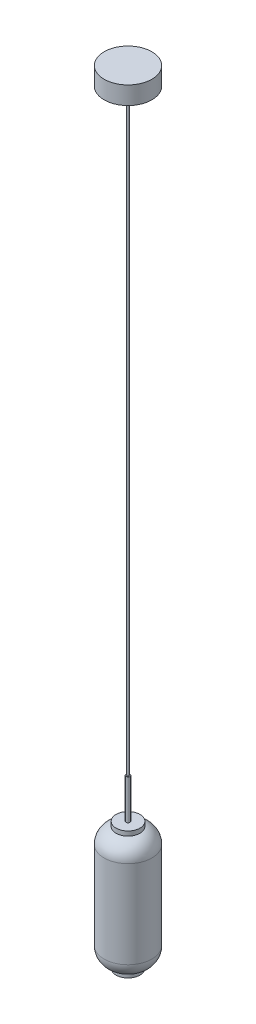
ISO-10303-21;
HEADER;
FILE_DESCRIPTION(('STEP AP214'),'2;1');
FILE_NAME('part.step','',(''),(''),'','','');
FILE_SCHEMA(('AUTOMOTIVE_DESIGN { 1 0 10303 214 1 1 1 1 }'));
ENDSEC;
DATA;
#1=APPLICATION_CONTEXT('core data for automotive mechanical design processes');
#2=APPLICATION_PROTOCOL_DEFINITION('international standard','automotive_design',2000,#1);
#3=PRODUCT_CONTEXT('',#1,'mechanical');
#4=PRODUCT('Part','Part','',(#3));
#5=PRODUCT_RELATED_PRODUCT_CATEGORY('part','',(#4));
#6=PRODUCT_DEFINITION_FORMATION('','',#4);
#7=PRODUCT_DEFINITION_CONTEXT('part definition',#1,'design');
#8=PRODUCT_DEFINITION('design','',#6,#7);
#9=PRODUCT_DEFINITION_SHAPE('','',#8);
#10=(LENGTH_UNIT() NAMED_UNIT(*) SI_UNIT(.MILLI.,.METRE.));
#11=(NAMED_UNIT(*) PLANE_ANGLE_UNIT() SI_UNIT($,.RADIAN.));
#12=(NAMED_UNIT(*) SI_UNIT($,.STERADIAN.) SOLID_ANGLE_UNIT());
#13=UNCERTAINTY_MEASURE_WITH_UNIT(LENGTH_MEASURE(1.E-05),#10,'distance_accuracy_value','');
#14=(GEOMETRIC_REPRESENTATION_CONTEXT(3) GLOBAL_UNCERTAINTY_ASSIGNED_CONTEXT((#13)) GLOBAL_UNIT_ASSIGNED_CONTEXT((#10,
#11,#12)) REPRESENTATION_CONTEXT('',''));
#15=CARTESIAN_POINT('',(0.,0.,0.));
#16=DIRECTION('',(0.,0.,1.));
#17=DIRECTION('',(1.,0.,0.));
#18=AXIS2_PLACEMENT_3D('',#15,#16,#17);
#19=CARTESIAN_POINT('',(0.,1910.,0.));
#20=DIRECTION('',(0.,-1.,0.));
#21=DIRECTION('',(0.,0.,-1.));
#22=AXIS2_PLACEMENT_3D('',#19,#20,#21);
#23=CYLINDRICAL_SURFACE('',#22,2.5);
#24=CARTESIAN_POINT('',(0.,1910.,0.));
#25=DIRECTION('',(0.,1.,0.));
#26=DIRECTION('',(0.,0.,1.));
#27=AXIS2_PLACEMENT_3D('',#24,#25,#26);
#28=CIRCLE('',#27,2.5);
#29=CARTESIAN_POINT('',(0.,1910.,2.5));
#30=VERTEX_POINT('',#29);
#31=EDGE_CURVE('E11',#30,#30,#28,.T.);
#32=ORIENTED_EDGE('',*,*,#31,.F.);
#33=EDGE_LOOP('',(#32));
#34=FACE_BOUND('',#33,.T.);
#35=CARTESIAN_POINT('',(0.,410.,0.));
#36=DIRECTION('',(0.,1.,0.));
#37=DIRECTION('',(0.,0.,1.));
#38=AXIS2_PLACEMENT_3D('',#35,#36,#37);
#39=CIRCLE('',#38,2.5);
#40=CARTESIAN_POINT('',(0.,410.,2.5));
#41=VERTEX_POINT('',#40);
#42=EDGE_CURVE('E47',#41,#41,#39,.T.);
#43=ORIENTED_EDGE('',*,*,#42,.T.);
#44=EDGE_LOOP('',(#43));
#45=FACE_BOUND('',#44,.T.);
#46=ADVANCED_FACE('F44',(#34,#45),#23,.T.);
#47=CARTESIAN_POINT('',(0.,410.,0.));
#48=DIRECTION('',(0.,1.,0.));
#49=DIRECTION('',(0.,0.,1.));
#50=AXIS2_PLACEMENT_3D('',#47,#48,#49);
#51=PLANE('',#50);
#52=ORIENTED_EDGE('',*,*,#42,.F.);
#53=EDGE_LOOP('',(#52));
#54=FACE_BOUND('',#53,.T.);
#55=ADVANCED_FACE('F67',(#54),#51,.F.);
#56=CARTESIAN_POINT('',(0.,1954.958,0.));
#57=DIRECTION('',(0.,-1.,0.));
#58=DIRECTION('',(0.,0.,-1.));
#59=AXIS2_PLACEMENT_3D('',#56,#57,#58);
#60=CYLINDRICAL_SURFACE('',#59,59.944);
#61=CARTESIAN_POINT('',(0.,1954.958,0.));
#62=DIRECTION('',(0.,1.,0.));
#63=DIRECTION('',(0.,0.,1.));
#64=AXIS2_PLACEMENT_3D('',#61,#62,#63);
#65=CIRCLE('',#64,59.944);
#66=CARTESIAN_POINT('',(0.,1954.958,59.944));
#67=VERTEX_POINT('',#66);
#68=EDGE_CURVE('E54',#67,#67,#65,.T.);
#69=ORIENTED_EDGE('',*,*,#68,.F.);
#70=EDGE_LOOP('',(#69));
#71=FACE_BOUND('',#70,.T.);
#72=CARTESIAN_POINT('',(0.,1910.,0.));
#73=DIRECTION('',(0.,1.,0.));
#74=DIRECTION('',(0.,0.,1.));
#75=AXIS2_PLACEMENT_3D('',#72,#73,#74);
#76=CIRCLE('',#75,59.944);
#77=CARTESIAN_POINT('',(0.,1910.,59.944));
#78=VERTEX_POINT('',#77);
#79=EDGE_CURVE('E56',#78,#78,#76,.T.);
#80=ORIENTED_EDGE('',*,*,#79,.T.);
#81=EDGE_LOOP('',(#80));
#82=FACE_BOUND('',#81,.T.);
#83=ADVANCED_FACE('F64',(#71,#82),#60,.T.);
#84=CARTESIAN_POINT('',(0.,1954.958,0.));
#85=DIRECTION('',(0.,1.,0.));
#86=DIRECTION('',(0.,0.,1.));
#87=AXIS2_PLACEMENT_3D('',#84,#85,#86);
#88=PLANE('',#87);
#89=ORIENTED_EDGE('',*,*,#68,.T.);
#90=EDGE_LOOP('',(#89));
#91=FACE_BOUND('',#90,.T.);
#92=ADVANCED_FACE('F62',(#91),#88,.T.);
#93=CARTESIAN_POINT('',(0.,1910.,0.));
#94=DIRECTION('',(0.,1.,0.));
#95=DIRECTION('',(0.,0.,1.));
#96=AXIS2_PLACEMENT_3D('',#93,#94,#95);
#97=PLANE('',#96);
#98=ORIENTED_EDGE('',*,*,#31,.T.);
#99=EDGE_LOOP('',(#98));
#100=FACE_BOUND('',#99,.T.);
#101=ORIENTED_EDGE('',*,*,#79,.F.);
#102=EDGE_LOOP('',(#101));
#103=FACE_BOUND('',#102,.T.);
#104=ADVANCED_FACE('F71',(#100,#103),#97,.F.);
#105=CLOSED_SHELL('',(#46,#55,#83,#92,#104));
#106=MANIFOLD_SOLID_BREP('B2',#105);
#107=CARTESIAN_POINT('',(0.,5.,0.));
#108=DIRECTION('',(0.,1.,0.));
#109=DIRECTION('',(0.,0.,1.));
#110=AXIS2_PLACEMENT_3D('',#107,#108,#109);
#111=CYLINDRICAL_SURFACE('',#110,30.);
#112=CARTESIAN_POINT('',(0.,5.,0.));
#113=DIRECTION('',(0.,1.,0.));
#114=DIRECTION('',(0.,0.,1.));
#115=AXIS2_PLACEMENT_3D('',#112,#113,#114);
#116=CIRCLE('',#115,30.);
#117=CARTESIAN_POINT('',(0.,5.,30.));
#118=VERTEX_POINT('',#117);
#119=EDGE_CURVE('E43',#118,#118,#116,.T.);
#120=ORIENTED_EDGE('',*,*,#119,.T.);
#121=EDGE_LOOP('',(#120));
#122=FACE_BOUND('',#121,.T.);
#123=CARTESIAN_POINT('',(0.,295.,0.));
#124=DIRECTION('',(0.,1.,0.));
#125=DIRECTION('',(0.,0.,1.));
#126=AXIS2_PLACEMENT_3D('',#123,#124,#125);
#127=CIRCLE('',#126,30.);
#128=CARTESIAN_POINT('',(0.,295.,30.));
#129=VERTEX_POINT('',#128);
#130=EDGE_CURVE('E134',#129,#129,#127,.T.);
#131=ORIENTED_EDGE('',*,*,#130,.F.);
#132=EDGE_LOOP('',(#131));
#133=FACE_BOUND('',#132,.T.);
#134=ADVANCED_FACE('F128',(#122,#133),#111,.T.);
#135=CARTESIAN_POINT('',(0.,5.,0.));
#136=DIRECTION('',(0.,1.,0.));
#137=DIRECTION('',(0.,0.,1.));
#138=AXIS2_PLACEMENT_3D('',#135,#136,#137);
#139=PLANE('',#138);
#140=ORIENTED_EDGE('',*,*,#119,.F.);
#141=EDGE_LOOP('',(#140));
#142=FACE_BOUND('',#141,.T.);
#143=ADVANCED_FACE('F143',(#142),#139,.F.);
#144=CARTESIAN_POINT('',(0.,295.,0.));
#145=DIRECTION('',(0.,1.,0.));
#146=DIRECTION('',(0.,0.,1.));
#147=AXIS2_PLACEMENT_3D('',#144,#145,#146);
#148=PLANE('',#147);
#149=ORIENTED_EDGE('',*,*,#130,.T.);
#150=EDGE_LOOP('',(#149));
#151=FACE_BOUND('',#150,.T.);
#152=ADVANCED_FACE('F140',(#151),#148,.T.);
#153=CLOSED_SHELL('',(#134,#143,#152));
#154=MANIFOLD_SOLID_BREP('B6',#153);
#155=CARTESIAN_POINT('',(0.,-10.,0.));
#156=DIRECTION('',(0.,1.,0.));
#157=DIRECTION('',(0.,0.,-1.));
#158=AXIS2_PLACEMENT_3D('',#155,#156,#157);
#159=CYLINDRICAL_SURFACE('',#158,30.);
#160=CARTESIAN_POINT('',(0.,-10.,0.));
#161=DIRECTION('',(0.,1.,0.));
#162=DIRECTION('',(0.,0.,1.));
#163=AXIS2_PLACEMENT_3D('',#160,#161,#162);
#164=CIRCLE('',#163,30.);
#165=CARTESIAN_POINT('',(0.,-10.,30.));
#166=VERTEX_POINT('',#165);
#167=EDGE_CURVE('E182',#166,#166,#164,.T.);
#168=ORIENTED_EDGE('',*,*,#167,.T.);
#169=EDGE_LOOP('',(#168));
#170=FACE_BOUND('',#169,.T.);
#171=CARTESIAN_POINT('',(0.,1.27016653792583,0.));
#172=DIRECTION('',(0.,-1.,0.));
#173=DIRECTION('',(0.,0.,-1.));
#174=AXIS2_PLACEMENT_3D('',#171,#172,#173);
#175=CIRCLE('',#174,30.);
#176=CARTESIAN_POINT('',(0.,1.27016653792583,-30.));
#177=VERTEX_POINT('',#176);
#178=EDGE_CURVE('E186',#177,#177,#175,.F.);
#179=ORIENTED_EDGE('',*,*,#178,.F.);
#180=EDGE_LOOP('',(#179));
#181=FACE_BOUND('',#180,.T.);
#182=ADVANCED_FACE('F176',(#170,#181),#159,.T.);
#183=CARTESIAN_POINT('',(0.,-10.,0.));
#184=DIRECTION('',(0.,-1.,0.));
#185=DIRECTION('',(0.,0.,1.));
#186=AXIS2_PLACEMENT_3D('',#183,#184,#185);
#187=PLANE('',#186);
#188=ORIENTED_EDGE('',*,*,#167,.F.);
#189=EDGE_LOOP('',(#188));
#190=FACE_BOUND('',#189,.T.);
#191=ADVANCED_FACE('F197',(#190),#187,.T.);
#192=CARTESIAN_POINT('',(0.,40.,0.));
#193=DIRECTION('',(0.,1.,0.));
#194=DIRECTION('',(0.,0.,-1.));
#195=AXIS2_PLACEMENT_3D('',#192,#193,#194);
#196=DEGENERATE_TOROIDAL_SURFACE('',#195,20.,40.,.T.);
#197=ORIENTED_EDGE('',*,*,#178,.T.);
#198=EDGE_LOOP('',(#197));
#199=FACE_BOUND('',#198,.T.);
#200=CARTESIAN_POINT('',(0.,0.,0.));
#201=DIRECTION('',(0.,-1.,0.));
#202=DIRECTION('',(0.,0.,-1.));
#203=AXIS2_PLACEMENT_3D('',#200,#201,#202);
#204=CIRCLE('',#203,20.);
#205=CARTESIAN_POINT('',(0.,0.,-20.));
#206=VERTEX_POINT('',#205);
#207=EDGE_CURVE('E127',#206,#206,#204,.F.);
#208=ORIENTED_EDGE('',*,*,#207,.F.);
#209=EDGE_LOOP('',(#208));
#210=FACE_BOUND('',#209,.T.);
#211=ADVANCED_FACE('F193',(#199,#210),#196,.F.);
#212=CARTESIAN_POINT('',(0.,0.,0.));
#213=DIRECTION('',(0.,-1.,0.));
#214=DIRECTION('',(0.,0.,1.));
#215=AXIS2_PLACEMENT_3D('',#212,#213,#214);
#216=PLANE('',#215);
#217=ORIENTED_EDGE('',*,*,#207,.T.);
#218=EDGE_LOOP('',(#217));
#219=FACE_BOUND('',#218,.T.);
#220=ADVANCED_FACE('F206',(#219),#216,.F.);
#221=CLOSED_SHELL('',(#182,#191,#211,#220));
#222=MANIFOLD_SOLID_BREP('B38',#221);
#223=CARTESIAN_POINT('',(0.,310.,0.));
#224=DIRECTION('',(0.,-1.,0.));
#225=DIRECTION('',(0.,0.,-1.));
#226=AXIS2_PLACEMENT_3D('',#223,#224,#225);
#227=CYLINDRICAL_SURFACE('',#226,30.);
#228=CARTESIAN_POINT('',(0.,310.,0.));
#229=DIRECTION('',(0.,1.,0.));
#230=DIRECTION('',(0.,0.,1.));
#231=AXIS2_PLACEMENT_3D('',#228,#229,#230);
#232=CIRCLE('',#231,30.);
#233=CARTESIAN_POINT('',(0.,310.,30.));
#234=VERTEX_POINT('',#233);
#235=EDGE_CURVE('E249',#234,#234,#232,.T.);
#236=ORIENTED_EDGE('',*,*,#235,.F.);
#237=EDGE_LOOP('',(#236));
#238=FACE_BOUND('',#237,.T.);
#239=CARTESIAN_POINT('',(0.,298.729833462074,0.));
#240=DIRECTION('',(0.,-1.,0.));
#241=DIRECTION('',(0.,0.,-1.));
#242=AXIS2_PLACEMENT_3D('',#239,#240,#241);
#243=CIRCLE('',#242,30.);
#244=CARTESIAN_POINT('',(0.,298.729833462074,-30.));
#245=VERTEX_POINT('',#244);
#246=EDGE_CURVE('E253',#245,#245,#243,.F.);
#247=ORIENTED_EDGE('',*,*,#246,.T.);
#248=EDGE_LOOP('',(#247));
#249=FACE_BOUND('',#248,.T.);
#250=ADVANCED_FACE('F238',(#238,#249),#227,.T.);
#251=CARTESIAN_POINT('',(0.,310.,0.));
#252=DIRECTION('',(0.,1.,0.));
#253=DIRECTION('',(0.,0.,1.));
#254=AXIS2_PLACEMENT_3D('',#251,#252,#253);
#255=PLANE('',#254);
#256=CARTESIAN_POINT('',(0.,310.,0.));
#257=DIRECTION('',(0.,1.,0.));
#258=DIRECTION('',(0.,0.,1.));
#259=AXIS2_PLACEMENT_3D('',#256,#257,#258);
#260=CIRCLE('',#259,5.);
#261=CARTESIAN_POINT('',(0.,310.,5.));
#262=VERTEX_POINT('',#261);
#263=EDGE_CURVE('E175',#262,#262,#260,.T.);
#264=ORIENTED_EDGE('',*,*,#263,.F.);
#265=EDGE_LOOP('',(#264));
#266=FACE_BOUND('',#265,.T.);
#267=ORIENTED_EDGE('',*,*,#235,.T.);
#268=EDGE_LOOP('',(#267));
#269=FACE_BOUND('',#268,.T.);
#270=ADVANCED_FACE('F258',(#266,#269),#255,.T.);
#271=CARTESIAN_POINT('',(0.,260.,0.));
#272=DIRECTION('',(0.,-1.,0.));
#273=DIRECTION('',(0.,0.,-1.));
#274=AXIS2_PLACEMENT_3D('',#271,#272,#273);
#275=DEGENERATE_TOROIDAL_SURFACE('',#274,20.,40.,.T.);
#276=ORIENTED_EDGE('',*,*,#246,.F.);
#277=EDGE_LOOP('',(#276));
#278=FACE_BOUND('',#277,.T.);
#279=CARTESIAN_POINT('',(0.,300.,0.));
#280=DIRECTION('',(0.,-1.,0.));
#281=DIRECTION('',(0.,0.,-1.));
#282=AXIS2_PLACEMENT_3D('',#279,#280,#281);
#283=CIRCLE('',#282,20.);
#284=CARTESIAN_POINT('',(0.,300.,-20.));
#285=VERTEX_POINT('',#284);
#286=EDGE_CURVE('E241',#285,#285,#283,.F.);
#287=ORIENTED_EDGE('',*,*,#286,.T.);
#288=EDGE_LOOP('',(#287));
#289=FACE_BOUND('',#288,.T.);
#290=ADVANCED_FACE('F264',(#278,#289),#275,.F.);
#291=CARTESIAN_POINT('',(0.,300.,0.));
#292=DIRECTION('',(0.,1.,0.));
#293=DIRECTION('',(0.,0.,1.));
#294=AXIS2_PLACEMENT_3D('',#291,#292,#293);
#295=PLANE('',#294);
#296=ORIENTED_EDGE('',*,*,#286,.F.);
#297=EDGE_LOOP('',(#296));
#298=FACE_BOUND('',#297,.T.);
#299=ADVANCED_FACE('F267',(#298),#295,.F.);
#300=CARTESIAN_POINT('',(0.,410.,0.));
#301=DIRECTION('',(0.,-1.,0.));
#302=DIRECTION('',(0.,0.,-1.));
#303=AXIS2_PLACEMENT_3D('',#300,#301,#302);
#304=CYLINDRICAL_SURFACE('',#303,5.);
#305=CARTESIAN_POINT('',(0.,410.,0.));
#306=DIRECTION('',(0.,1.,0.));
#307=DIRECTION('',(0.,0.,1.));
#308=AXIS2_PLACEMENT_3D('',#305,#306,#307);
#309=CIRCLE('',#308,5.);
#310=CARTESIAN_POINT('',(0.,410.,5.));
#311=VERTEX_POINT('',#310);
#312=EDGE_CURVE('E252',#311,#311,#309,.T.);
#313=ORIENTED_EDGE('',*,*,#312,.F.);
#314=EDGE_LOOP('',(#313));
#315=FACE_BOUND('',#314,.T.);
#316=ORIENTED_EDGE('',*,*,#263,.T.);
#317=EDGE_LOOP('',(#316));
#318=FACE_BOUND('',#317,.T.);
#319=ADVANCED_FACE('F272',(#315,#318),#304,.T.);
#320=CARTESIAN_POINT('',(0.,410.,0.));
#321=DIRECTION('',(0.,1.,0.));
#322=DIRECTION('',(0.,0.,1.));
#323=AXIS2_PLACEMENT_3D('',#320,#321,#322);
#324=PLANE('',#323);
#325=ORIENTED_EDGE('',*,*,#312,.T.);
#326=EDGE_LOOP('',(#325));
#327=FACE_BOUND('',#326,.T.);
#328=ADVANCED_FACE('F276',(#327),#324,.T.);
#329=CLOSED_SHELL('',(#250,#270,#290,#299,#319,#328));
#330=MANIFOLD_SOLID_BREP('B122',#329);
#331=CARTESIAN_POINT('',(-20.,300.,0.));
#332=DIRECTION('',(0.,-1.,0.));
#333=DIRECTION('',(0.,0.,-1.));
#334=AXIS2_PLACEMENT_3D('',#331,#332,#333);
#335=PLANE('',#334);
#336=CARTESIAN_POINT('',(0.,300.,0.));
#337=DIRECTION('',(0.,-1.,0.));
#338=DIRECTION('',(0.,0.,-1.));
#339=AXIS2_PLACEMENT_3D('',#336,#337,#338);
#340=CIRCLE('',#339,20.);
#341=CARTESIAN_POINT('',(0.,300.,-20.));
#342=VERTEX_POINT('',#341);
#343=EDGE_CURVE('E237',#342,#342,#340,.T.);
#344=ORIENTED_EDGE('',*,*,#343,.F.);
#345=EDGE_LOOP('',(#344));
#346=FACE_BOUND('',#345,.T.);
#347=ADVANCED_FACE('F323',(#346),#335,.F.);
#348=CARTESIAN_POINT('',(0.,260.,0.));
#349=DIRECTION('',(0.,-1.,0.));
#350=DIRECTION('',(0.,0.,-1.));
#351=AXIS2_PLACEMENT_3D('',#348,#349,#350);
#352=DEGENERATE_TOROIDAL_SURFACE('',#351,20.,40.,.T.);
#353=CARTESIAN_POINT('',(0.,260.,0.));
#354=DIRECTION('',(0.,-1.,0.));
#355=DIRECTION('',(0.,0.,-1.));
#356=AXIS2_PLACEMENT_3D('',#353,#354,#355);
#357=CIRCLE('',#356,60.);
#358=CARTESIAN_POINT('',(0.,260.,-60.));
#359=VERTEX_POINT('',#358);
#360=EDGE_CURVE('E329',#359,#359,#357,.T.);
#361=ORIENTED_EDGE('',*,*,#360,.F.);
#362=EDGE_LOOP('',(#361));
#363=FACE_BOUND('',#362,.T.);
#364=ORIENTED_EDGE('',*,*,#343,.T.);
#365=EDGE_LOOP('',(#364));
#366=FACE_BOUND('',#365,.T.);
#367=ADVANCED_FACE('F366',(#363,#366),#352,.T.);
#368=CARTESIAN_POINT('',(0.,0.,0.));
#369=DIRECTION('',(0.,-1.,0.));
#370=DIRECTION('',(0.,0.,-1.));
#371=AXIS2_PLACEMENT_3D('',#368,#369,#370);
#372=CYLINDRICAL_SURFACE('',#371,60.);
#373=CARTESIAN_POINT('',(0.,40.,0.));
#374=DIRECTION('',(0.,-1.,0.));
#375=DIRECTION('',(0.,0.,-1.));
#376=AXIS2_PLACEMENT_3D('',#373,#374,#375);
#377=CIRCLE('',#376,60.);
#378=CARTESIAN_POINT('',(0.,40.,-60.));
#379=VERTEX_POINT('',#378);
#380=EDGE_CURVE('E333',#379,#379,#377,.T.);
#381=ORIENTED_EDGE('',*,*,#380,.F.);
#382=EDGE_LOOP('',(#381));
#383=FACE_BOUND('',#382,.T.);
#384=ORIENTED_EDGE('',*,*,#360,.T.);
#385=EDGE_LOOP('',(#384));
#386=FACE_BOUND('',#385,.T.);
#387=ADVANCED_FACE('F361',(#383,#386),#372,.T.);
#388=CARTESIAN_POINT('',(0.,40.,0.));
#389=DIRECTION('',(0.,-1.,0.));
#390=DIRECTION('',(0.,0.,-1.));
#391=AXIS2_PLACEMENT_3D('',#388,#389,#390);
#392=DEGENERATE_TOROIDAL_SURFACE('',#391,20.,40.,.T.);
#393=CARTESIAN_POINT('',(0.,0.,0.));
#394=DIRECTION('',(0.,-1.,0.));
#395=DIRECTION('',(0.,0.,-1.));
#396=AXIS2_PLACEMENT_3D('',#393,#394,#395);
#397=CIRCLE('',#396,20.);
#398=CARTESIAN_POINT('',(0.,0.,-20.));
#399=VERTEX_POINT('',#398);
#400=EDGE_CURVE('E347',#399,#399,#397,.T.);
#401=ORIENTED_EDGE('',*,*,#400,.F.);
#402=EDGE_LOOP('',(#401));
#403=FACE_BOUND('',#402,.T.);
#404=ORIENTED_EDGE('',*,*,#380,.T.);
#405=EDGE_LOOP('',(#404));
#406=FACE_BOUND('',#405,.T.);
#407=ADVANCED_FACE('F358',(#403,#406),#392,.T.);
#408=CARTESIAN_POINT('',(0.,0.,0.));
#409=DIRECTION('',(0.,1.,0.));
#410=DIRECTION('',(0.,0.,1.));
#411=AXIS2_PLACEMENT_3D('',#408,#409,#410);
#412=CYLINDRICAL_SURFACE('',#411,20.);
#413=ORIENTED_EDGE('',*,*,#400,.T.);
#414=EDGE_LOOP('',(#413));
#415=FACE_BOUND('',#414,.T.);
#416=CARTESIAN_POINT('',(0.,8.,0.));
#417=DIRECTION('',(0.,1.,0.));
#418=DIRECTION('',(0.,0.,1.));
#419=AXIS2_PLACEMENT_3D('',#416,#417,#418);
#420=CIRCLE('',#419,20.);
#421=CARTESIAN_POINT('',(0.,8.,20.));
#422=VERTEX_POINT('',#421);
#423=EDGE_CURVE('E337',#422,#422,#420,.F.);
#424=ORIENTED_EDGE('',*,*,#423,.F.);
#425=EDGE_LOOP('',(#424));
#426=FACE_BOUND('',#425,.T.);
#427=ADVANCED_FACE('F355',(#415,#426),#412,.F.);
#428=CARTESIAN_POINT('',(-20.,292.,0.));
#429=DIRECTION('',(0.,-1.,0.));
#430=DIRECTION('',(0.,0.,-1.));
#431=AXIS2_PLACEMENT_3D('',#428,#429,#430);
#432=PLANE('',#431);
#433=CARTESIAN_POINT('',(0.,292.,0.));
#434=DIRECTION('',(0.,-1.,0.));
#435=DIRECTION('',(0.,0.,-1.));
#436=AXIS2_PLACEMENT_3D('',#433,#434,#435);
#437=CIRCLE('',#436,20.);
#438=CARTESIAN_POINT('',(0.,292.,-20.));
#439=VERTEX_POINT('',#438);
#440=EDGE_CURVE('E342',#439,#439,#437,.T.);
#441=ORIENTED_EDGE('',*,*,#440,.T.);
#442=EDGE_LOOP('',(#441));
#443=FACE_BOUND('',#442,.T.);
#444=ADVANCED_FACE('F400',(#443),#432,.T.);
#445=CARTESIAN_POINT('',(0.,260.,0.));
#446=DIRECTION('',(0.,-1.,0.));
#447=DIRECTION('',(0.,0.,-1.));
#448=AXIS2_PLACEMENT_3D('',#445,#446,#447);
#449=DEGENERATE_TOROIDAL_SURFACE('',#448,20.,32.,.T.);
#450=CARTESIAN_POINT('',(0.,260.,0.));
#451=DIRECTION('',(0.,-1.,0.));
#452=DIRECTION('',(0.,0.,-1.));
#453=AXIS2_PLACEMENT_3D('',#450,#451,#452);
#454=CIRCLE('',#453,52.);
#455=CARTESIAN_POINT('',(0.,260.,-52.));
#456=VERTEX_POINT('',#455);
#457=EDGE_CURVE('E346',#456,#456,#454,.T.);
#458=ORIENTED_EDGE('',*,*,#457,.T.);
#459=EDGE_LOOP('',(#458));
#460=FACE_BOUND('',#459,.T.);
#461=ORIENTED_EDGE('',*,*,#440,.F.);
#462=EDGE_LOOP('',(#461));
#463=FACE_BOUND('',#462,.T.);
#464=ADVANCED_FACE('F409',(#460,#463),#449,.F.);
#465=CARTESIAN_POINT('',(0.,0.,0.));
#466=DIRECTION('',(0.,-1.,0.));
#467=DIRECTION('',(0.,0.,-1.));
#468=AXIS2_PLACEMENT_3D('',#465,#466,#467);
#469=CYLINDRICAL_SURFACE('',#468,52.);
#470=CARTESIAN_POINT('',(0.,40.,0.));
#471=DIRECTION('',(0.,-1.,0.));
#472=DIRECTION('',(0.,0.,-1.));
#473=AXIS2_PLACEMENT_3D('',#470,#471,#472);
#474=CIRCLE('',#473,52.);
#475=CARTESIAN_POINT('',(0.,40.,-52.));
#476=VERTEX_POINT('',#475);
#477=EDGE_CURVE('E343',#476,#476,#474,.T.);
#478=ORIENTED_EDGE('',*,*,#477,.T.);
#479=EDGE_LOOP('',(#478));
#480=FACE_BOUND('',#479,.T.);
#481=ORIENTED_EDGE('',*,*,#457,.F.);
#482=EDGE_LOOP('',(#481));
#483=FACE_BOUND('',#482,.T.);
#484=ADVANCED_FACE('F419',(#480,#483),#469,.F.);
#485=CARTESIAN_POINT('',(0.,40.,0.));
#486=DIRECTION('',(0.,-1.,0.));
#487=DIRECTION('',(0.,0.,-1.));
#488=AXIS2_PLACEMENT_3D('',#485,#486,#487);
#489=DEGENERATE_TOROIDAL_SURFACE('',#488,20.,32.,.T.);
#490=ORIENTED_EDGE('',*,*,#423,.T.);
#491=EDGE_LOOP('',(#490));
#492=FACE_BOUND('',#491,.T.);
#493=ORIENTED_EDGE('',*,*,#477,.F.);
#494=EDGE_LOOP('',(#493));
#495=FACE_BOUND('',#494,.T.);
#496=ADVANCED_FACE('F429',(#492,#495),#489,.F.);
#497=CLOSED_SHELL('',(#347,#367,#387,#407,#427,#444,#464,#484,#496));
#498=MANIFOLD_SOLID_BREP('B170',#497);
#499=ADVANCED_BREP_SHAPE_REPRESENTATION('',(#18,#106,#154,#222,#330,#498),#14);
#500=SHAPE_DEFINITION_REPRESENTATION(#9,#499);
ENDSEC;
END-ISO-10303-21;
